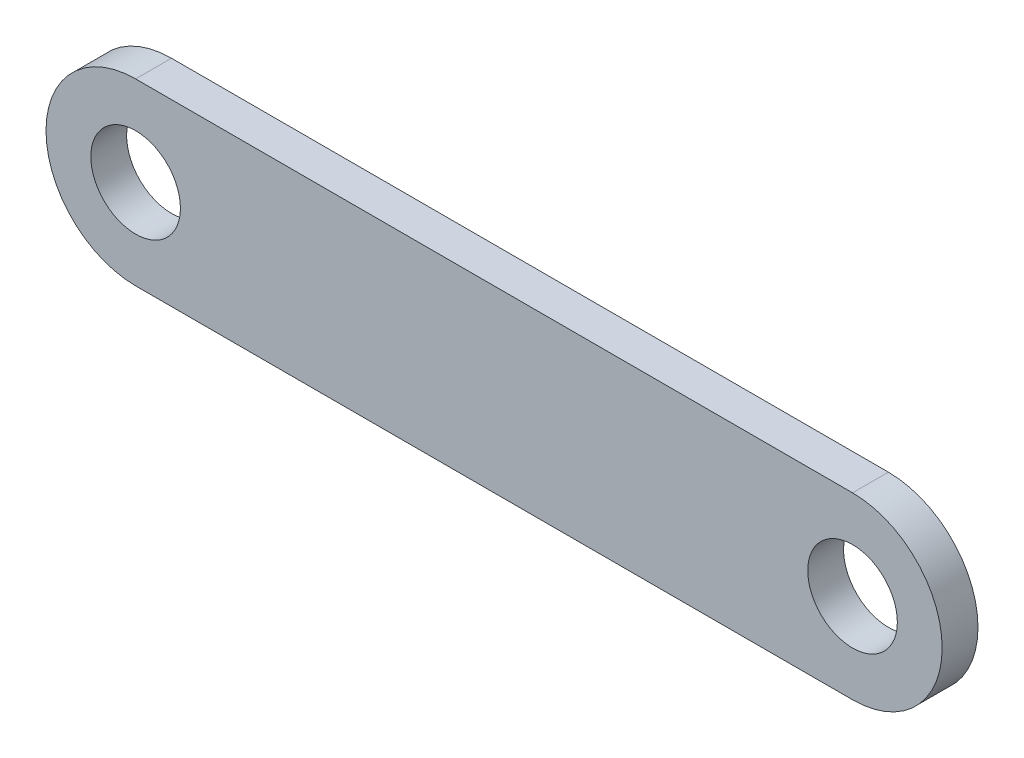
ISO-10303-21;
HEADER;
FILE_DESCRIPTION(('STEP AP214'),'2;1');
FILE_NAME('part.step','',(''),(''),'','','');
FILE_SCHEMA(('AUTOMOTIVE_DESIGN { 1 0 10303 214 1 1 1 1 }'));
ENDSEC;
DATA;
#1=APPLICATION_CONTEXT('core data for automotive mechanical design processes');
#2=APPLICATION_PROTOCOL_DEFINITION('international standard','automotive_design',2000,#1);
#3=PRODUCT_CONTEXT('',#1,'mechanical');
#4=PRODUCT('Part','Part','',(#3));
#5=PRODUCT_RELATED_PRODUCT_CATEGORY('part','',(#4));
#6=PRODUCT_DEFINITION_FORMATION('','',#4);
#7=PRODUCT_DEFINITION_CONTEXT('part definition',#1,'design');
#8=PRODUCT_DEFINITION('design','',#6,#7);
#9=PRODUCT_DEFINITION_SHAPE('','',#8);
#10=(LENGTH_UNIT() NAMED_UNIT(*) SI_UNIT(.MILLI.,.METRE.));
#11=(NAMED_UNIT(*) PLANE_ANGLE_UNIT() SI_UNIT($,.RADIAN.));
#12=(NAMED_UNIT(*) SI_UNIT($,.STERADIAN.) SOLID_ANGLE_UNIT());
#13=UNCERTAINTY_MEASURE_WITH_UNIT(LENGTH_MEASURE(1.E-05),#10,'distance_accuracy_value','');
#14=(GEOMETRIC_REPRESENTATION_CONTEXT(3) GLOBAL_UNCERTAINTY_ASSIGNED_CONTEXT((#13)) GLOBAL_UNIT_ASSIGNED_CONTEXT((#10,
#11,#12)) REPRESENTATION_CONTEXT('',''));
#15=CARTESIAN_POINT('',(0.,0.,0.));
#16=DIRECTION('',(0.,0.,1.));
#17=DIRECTION('',(1.,0.,0.));
#18=AXIS2_PLACEMENT_3D('',#15,#16,#17);
#19=CARTESIAN_POINT('',(-20.,0.,1.));
#20=DIRECTION('',(0.,0.,1.));
#21=DIRECTION('',(1.,0.,0.));
#22=AXIS2_PLACEMENT_3D('',#19,#20,#21);
#23=PLANE('',#22);
#24=CARTESIAN_POINT('',(-20.,0.,1.));
#25=DIRECTION('',(0.,0.,1.));
#26=DIRECTION('',(1.,0.,0.));
#27=AXIS2_PLACEMENT_3D('',#24,#25,#26);
#28=CIRCLE('',#27,2.5);
#29=CARTESIAN_POINT('',(-17.5,0.,1.));
#30=VERTEX_POINT('',#29);
#31=EDGE_CURVE('E112',#30,#30,#28,.T.);
#32=ORIENTED_EDGE('',*,*,#31,.F.);
#33=EDGE_LOOP('',(#32));
#34=FACE_BOUND('',#33,.T.);
#35=CARTESIAN_POINT('',(-20.,0.,1.));
#36=DIRECTION('',(0.,0.,1.));
#37=DIRECTION('',(1.,0.,0.));
#38=AXIS2_PLACEMENT_3D('',#35,#36,#37);
#39=CIRCLE('',#38,5.);
#40=CARTESIAN_POINT('',(-20.,5.,1.));
#41=VERTEX_POINT('',#40);
#42=CARTESIAN_POINT('',(-20.,-5.,1.));
#43=VERTEX_POINT('',#42);
#44=EDGE_CURVE('E92',#41,#43,#39,.T.);
#45=ORIENTED_EDGE('',*,*,#44,.T.);
#46=DIRECTION('',(1.,0.,0.));
#47=VECTOR('',#46,1.);
#48=CARTESIAN_POINT('',(-20.,-5.,1.));
#49=LINE('',#48,#47);
#50=CARTESIAN_POINT('',(20.,-5.,1.));
#51=VERTEX_POINT('',#50);
#52=EDGE_CURVE('E87',#43,#51,#49,.T.);
#53=ORIENTED_EDGE('',*,*,#52,.T.);
#54=CARTESIAN_POINT('',(20.,0.,1.));
#55=DIRECTION('',(0.,0.,1.));
#56=DIRECTION('',(1.,0.,0.));
#57=AXIS2_PLACEMENT_3D('',#54,#55,#56);
#58=CIRCLE('',#57,5.);
#59=CARTESIAN_POINT('',(20.,5.,1.));
#60=VERTEX_POINT('',#59);
#61=EDGE_CURVE('E90',#51,#60,#58,.T.);
#62=ORIENTED_EDGE('',*,*,#61,.T.);
#63=DIRECTION('',(-1.,0.,0.));
#64=VECTOR('',#63,1.);
#65=CARTESIAN_POINT('',(-20.,5.,1.));
#66=LINE('',#65,#64);
#67=EDGE_CURVE('E57',#60,#41,#66,.T.);
#68=ORIENTED_EDGE('',*,*,#67,.T.);
#69=EDGE_LOOP('',(#45,#53,#62,#68));
#70=FACE_BOUND('',#69,.T.);
#71=CARTESIAN_POINT('',(20.,0.,1.));
#72=DIRECTION('',(0.,0.,1.));
#73=DIRECTION('',(1.,0.,0.));
#74=AXIS2_PLACEMENT_3D('',#71,#72,#73);
#75=CIRCLE('',#74,2.5);
#76=CARTESIAN_POINT('',(22.5,0.,1.));
#77=VERTEX_POINT('',#76);
#78=EDGE_CURVE('E134',#77,#77,#75,.T.);
#79=ORIENTED_EDGE('',*,*,#78,.F.);
#80=EDGE_LOOP('',(#79));
#81=FACE_BOUND('',#80,.T.);
#82=ADVANCED_FACE('F39',(#34,#70,#81),#23,.T.);
#83=CARTESIAN_POINT('',(-20.,0.,-1.));
#84=DIRECTION('',(0.,0.,1.));
#85=DIRECTION('',(1.,0.,0.));
#86=AXIS2_PLACEMENT_3D('',#83,#84,#85);
#87=PLANE('',#86);
#88=CARTESIAN_POINT('',(-20.,0.,-1.));
#89=DIRECTION('',(0.,0.,1.));
#90=DIRECTION('',(1.,0.,0.));
#91=AXIS2_PLACEMENT_3D('',#88,#89,#90);
#92=CIRCLE('',#91,5.);
#93=CARTESIAN_POINT('',(-20.,5.,-1.));
#94=VERTEX_POINT('',#93);
#95=CARTESIAN_POINT('',(-20.,-5.,-1.));
#96=VERTEX_POINT('',#95);
#97=EDGE_CURVE('E108',#94,#96,#92,.T.);
#98=ORIENTED_EDGE('',*,*,#97,.F.);
#99=DIRECTION('',(-1.,0.,0.));
#100=VECTOR('',#99,1.);
#101=CARTESIAN_POINT('',(-20.,5.,-1.));
#102=LINE('',#101,#100);
#103=CARTESIAN_POINT('',(20.,5.,-1.));
#104=VERTEX_POINT('',#103);
#105=EDGE_CURVE('E80',#104,#94,#102,.T.);
#106=ORIENTED_EDGE('',*,*,#105,.F.);
#107=CARTESIAN_POINT('',(20.,0.,-1.));
#108=DIRECTION('',(0.,0.,1.));
#109=DIRECTION('',(1.,0.,0.));
#110=AXIS2_PLACEMENT_3D('',#107,#108,#109);
#111=CIRCLE('',#110,5.);
#112=CARTESIAN_POINT('',(20.,-5.,-1.));
#113=VERTEX_POINT('',#112);
#114=EDGE_CURVE('E74',#113,#104,#111,.T.);
#115=ORIENTED_EDGE('',*,*,#114,.F.);
#116=DIRECTION('',(1.,0.,0.));
#117=VECTOR('',#116,1.);
#118=CARTESIAN_POINT('',(-20.,-5.,-1.));
#119=LINE('',#118,#117);
#120=EDGE_CURVE('E97',#96,#113,#119,.T.);
#121=ORIENTED_EDGE('',*,*,#120,.F.);
#122=EDGE_LOOP('',(#98,#106,#115,#121));
#123=FACE_BOUND('',#122,.T.);
#124=CARTESIAN_POINT('',(-20.,0.,-1.));
#125=DIRECTION('',(0.,0.,1.));
#126=DIRECTION('',(1.,0.,0.));
#127=AXIS2_PLACEMENT_3D('',#124,#125,#126);
#128=CIRCLE('',#127,2.5);
#129=CARTESIAN_POINT('',(-17.5,0.,-1.));
#130=VERTEX_POINT('',#129);
#131=EDGE_CURVE('E130',#130,#130,#128,.T.);
#132=ORIENTED_EDGE('',*,*,#131,.T.);
#133=EDGE_LOOP('',(#132));
#134=FACE_BOUND('',#133,.T.);
#135=CARTESIAN_POINT('',(20.,0.,-1.));
#136=DIRECTION('',(0.,0.,1.));
#137=DIRECTION('',(1.,0.,0.));
#138=AXIS2_PLACEMENT_3D('',#135,#136,#137);
#139=CIRCLE('',#138,2.5);
#140=CARTESIAN_POINT('',(22.5,0.,-1.));
#141=VERTEX_POINT('',#140);
#142=EDGE_CURVE('E138',#141,#141,#139,.T.);
#143=ORIENTED_EDGE('',*,*,#142,.T.);
#144=EDGE_LOOP('',(#143));
#145=FACE_BOUND('',#144,.T.);
#146=ADVANCED_FACE('F125',(#123,#134,#145),#87,.F.);
#147=CARTESIAN_POINT('',(-20.,0.,1.));
#148=DIRECTION('',(0.,0.,-1.));
#149=DIRECTION('',(-1.,0.,0.));
#150=AXIS2_PLACEMENT_3D('',#147,#148,#149);
#151=CYLINDRICAL_SURFACE('',#150,5.);
#152=ORIENTED_EDGE('',*,*,#97,.T.);
#153=DIRECTION('',(0.,0.,-1.));
#154=VECTOR('',#153,1.);
#155=CARTESIAN_POINT('',(-20.,-5.,1.));
#156=LINE('',#155,#154);
#157=EDGE_CURVE('E11',#43,#96,#156,.T.);
#158=ORIENTED_EDGE('',*,*,#157,.F.);
#159=ORIENTED_EDGE('',*,*,#44,.F.);
#160=DIRECTION('',(0.,0.,-1.));
#161=VECTOR('',#160,1.);
#162=CARTESIAN_POINT('',(-20.,5.,1.));
#163=LINE('',#162,#161);
#164=EDGE_CURVE('E104',#41,#94,#163,.T.);
#165=ORIENTED_EDGE('',*,*,#164,.T.);
#166=EDGE_LOOP('',(#152,#158,#159,#165));
#167=FACE_BOUND('',#166,.T.);
#168=ADVANCED_FACE('F41',(#167),#151,.T.);
#169=CARTESIAN_POINT('',(-20.,-5.,1.));
#170=DIRECTION('',(0.,1.,0.));
#171=DIRECTION('',(0.,0.,1.));
#172=AXIS2_PLACEMENT_3D('',#169,#170,#171);
#173=PLANE('',#172);
#174=ORIENTED_EDGE('',*,*,#120,.T.);
#175=DIRECTION('',(0.,0.,-1.));
#176=VECTOR('',#175,1.);
#177=CARTESIAN_POINT('',(20.,-5.,1.));
#178=LINE('',#177,#176);
#179=EDGE_CURVE('E49',#51,#113,#178,.T.);
#180=ORIENTED_EDGE('',*,*,#179,.F.);
#181=ORIENTED_EDGE('',*,*,#52,.F.);
#182=ORIENTED_EDGE('',*,*,#157,.T.);
#183=EDGE_LOOP('',(#174,#180,#181,#182));
#184=FACE_BOUND('',#183,.T.);
#185=ADVANCED_FACE('F96',(#184),#173,.F.);
#186=CARTESIAN_POINT('',(20.,0.,1.));
#187=DIRECTION('',(0.,0.,-1.));
#188=DIRECTION('',(-1.,0.,0.));
#189=AXIS2_PLACEMENT_3D('',#186,#187,#188);
#190=CYLINDRICAL_SURFACE('',#189,5.);
#191=ORIENTED_EDGE('',*,*,#114,.T.);
#192=DIRECTION('',(0.,0.,-1.));
#193=VECTOR('',#192,1.);
#194=CARTESIAN_POINT('',(20.,5.,1.));
#195=LINE('',#194,#193);
#196=EDGE_CURVE('E99',#60,#104,#195,.T.);
#197=ORIENTED_EDGE('',*,*,#196,.F.);
#198=ORIENTED_EDGE('',*,*,#61,.F.);
#199=ORIENTED_EDGE('',*,*,#179,.T.);
#200=EDGE_LOOP('',(#191,#197,#198,#199));
#201=FACE_BOUND('',#200,.T.);
#202=ADVANCED_FACE('F100',(#201),#190,.T.);
#203=CARTESIAN_POINT('',(-20.,5.,1.));
#204=DIRECTION('',(0.,-1.,0.));
#205=DIRECTION('',(1.,0.,0.));
#206=AXIS2_PLACEMENT_3D('',#203,#204,#205);
#207=PLANE('',#206);
#208=ORIENTED_EDGE('',*,*,#105,.T.);
#209=ORIENTED_EDGE('',*,*,#164,.F.);
#210=ORIENTED_EDGE('',*,*,#67,.F.);
#211=ORIENTED_EDGE('',*,*,#196,.T.);
#212=EDGE_LOOP('',(#208,#209,#210,#211));
#213=FACE_BOUND('',#212,.T.);
#214=ADVANCED_FACE('F122',(#213),#207,.F.);
#215=CARTESIAN_POINT('',(-20.,0.,1.));
#216=DIRECTION('',(0.,0.,-1.));
#217=DIRECTION('',(-1.,0.,0.));
#218=AXIS2_PLACEMENT_3D('',#215,#216,#217);
#219=CYLINDRICAL_SURFACE('',#218,2.5);
#220=ORIENTED_EDGE('',*,*,#31,.T.);
#221=EDGE_LOOP('',(#220));
#222=FACE_BOUND('',#221,.T.);
#223=ORIENTED_EDGE('',*,*,#131,.F.);
#224=EDGE_LOOP('',(#223));
#225=FACE_BOUND('',#224,.T.);
#226=ADVANCED_FACE('F157',(#222,#225),#219,.F.);
#227=CARTESIAN_POINT('',(20.,0.,1.));
#228=DIRECTION('',(0.,0.,-1.));
#229=DIRECTION('',(-1.,0.,0.));
#230=AXIS2_PLACEMENT_3D('',#227,#228,#229);
#231=CYLINDRICAL_SURFACE('',#230,2.5);
#232=ORIENTED_EDGE('',*,*,#78,.T.);
#233=EDGE_LOOP('',(#232));
#234=FACE_BOUND('',#233,.T.);
#235=ORIENTED_EDGE('',*,*,#142,.F.);
#236=EDGE_LOOP('',(#235));
#237=FACE_BOUND('',#236,.T.);
#238=ADVANCED_FACE('F146',(#234,#237),#231,.F.);
#239=CLOSED_SHELL('',(#82,#146,#168,#185,#202,#214,#226,#238));
#240=MANIFOLD_SOLID_BREP('B2',#239);
#241=ADVANCED_BREP_SHAPE_REPRESENTATION('',(#18,#240),#14);
#242=SHAPE_DEFINITION_REPRESENTATION(#9,#241);
ENDSEC;
END-ISO-10303-21;
